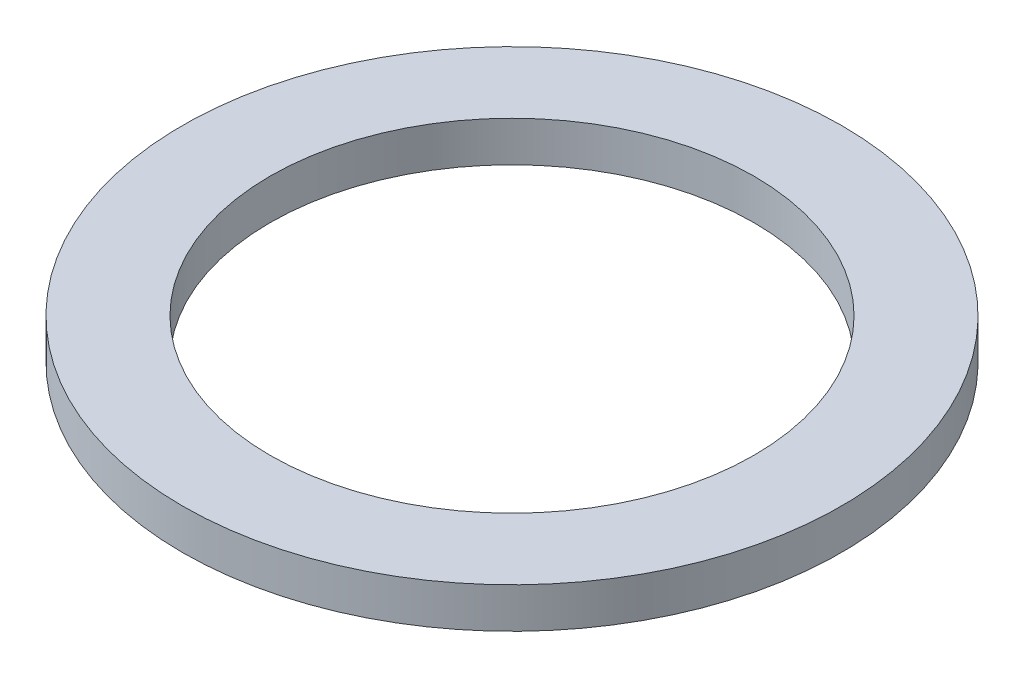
ISO-10303-21;
HEADER;
FILE_DESCRIPTION(('STEP AP214'),'2;1');
FILE_NAME('part.step','',(''),(''),'','','');
FILE_SCHEMA(('AUTOMOTIVE_DESIGN { 1 0 10303 214 1 1 1 1 }'));
ENDSEC;
DATA;
#1=APPLICATION_CONTEXT('core data for automotive mechanical design processes');
#2=APPLICATION_PROTOCOL_DEFINITION('international standard','automotive_design',2000,#1);
#3=PRODUCT_CONTEXT('',#1,'mechanical');
#4=PRODUCT('Part','Part','',(#3));
#5=PRODUCT_RELATED_PRODUCT_CATEGORY('part','',(#4));
#6=PRODUCT_DEFINITION_FORMATION('','',#4);
#7=PRODUCT_DEFINITION_CONTEXT('part definition',#1,'design');
#8=PRODUCT_DEFINITION('design','',#6,#7);
#9=PRODUCT_DEFINITION_SHAPE('','',#8);
#10=(LENGTH_UNIT() NAMED_UNIT(*) SI_UNIT(.MILLI.,.METRE.));
#11=(NAMED_UNIT(*) PLANE_ANGLE_UNIT() SI_UNIT($,.RADIAN.));
#12=(NAMED_UNIT(*) SI_UNIT($,.STERADIAN.) SOLID_ANGLE_UNIT());
#13=UNCERTAINTY_MEASURE_WITH_UNIT(LENGTH_MEASURE(1.E-05),#10,'distance_accuracy_value','');
#14=(GEOMETRIC_REPRESENTATION_CONTEXT(3) GLOBAL_UNCERTAINTY_ASSIGNED_CONTEXT((#13)) GLOBAL_UNIT_ASSIGNED_CONTEXT((#10,
#11,#12)) REPRESENTATION_CONTEXT('',''));
#15=CARTESIAN_POINT('',(0.,0.,0.));
#16=DIRECTION('',(0.,0.,1.));
#17=DIRECTION('',(1.,0.,0.));
#18=AXIS2_PLACEMENT_3D('',#15,#16,#17);
#19=CARTESIAN_POINT('',(0.,0.,0.));
#20=DIRECTION('',(0.,-1.,0.));
#21=DIRECTION('',(0.,0.,-1.));
#22=AXIS2_PLACEMENT_3D('',#19,#20,#21);
#23=CYLINDRICAL_SURFACE('',#22,12.);
#24=CARTESIAN_POINT('',(0.,0.,0.));
#25=DIRECTION('',(0.,-1.,0.));
#26=DIRECTION('',(0.,0.,-1.));
#27=AXIS2_PLACEMENT_3D('',#24,#25,#26);
#28=CIRCLE('',#27,12.);
#29=CARTESIAN_POINT('',(0.,0.,-12.));
#30=VERTEX_POINT('',#29);
#31=EDGE_CURVE('E28',#30,#30,#28,.T.);
#32=ORIENTED_EDGE('',*,*,#31,.T.);
#33=EDGE_LOOP('',(#32));
#34=FACE_BOUND('',#33,.T.);
#35=CARTESIAN_POINT('',(0.,2.,0.));
#36=DIRECTION('',(0.,-1.,0.));
#37=DIRECTION('',(0.,0.,-1.));
#38=AXIS2_PLACEMENT_3D('',#35,#36,#37);
#39=CIRCLE('',#38,12.);
#40=CARTESIAN_POINT('',(0.,2.,-12.));
#41=VERTEX_POINT('',#40);
#42=EDGE_CURVE('E10',#41,#41,#39,.T.);
#43=ORIENTED_EDGE('',*,*,#42,.F.);
#44=EDGE_LOOP('',(#43));
#45=FACE_BOUND('',#44,.T.);
#46=ADVANCED_FACE('F14',(#34,#45),#23,.F.);
#47=CARTESIAN_POINT('',(12.,2.,0.));
#48=DIRECTION('',(0.,1.,0.));
#49=DIRECTION('',(0.,0.,1.));
#50=AXIS2_PLACEMENT_3D('',#47,#48,#49);
#51=PLANE('',#50);
#52=ORIENTED_EDGE('',*,*,#42,.T.);
#53=EDGE_LOOP('',(#52));
#54=FACE_BOUND('',#53,.T.);
#55=CARTESIAN_POINT('',(0.,2.,0.));
#56=DIRECTION('',(0.,-1.,0.));
#57=DIRECTION('',(0.,0.,-1.));
#58=AXIS2_PLACEMENT_3D('',#55,#56,#57);
#59=CIRCLE('',#58,16.35);
#60=CARTESIAN_POINT('',(0.,2.,-16.35));
#61=VERTEX_POINT('',#60);
#62=EDGE_CURVE('E20',#61,#61,#59,.T.);
#63=ORIENTED_EDGE('',*,*,#62,.F.);
#64=EDGE_LOOP('',(#63));
#65=FACE_BOUND('',#64,.T.);
#66=ADVANCED_FACE('F46',(#54,#65),#51,.T.);
#67=CARTESIAN_POINT('',(0.,0.,0.));
#68=DIRECTION('',(0.,-1.,0.));
#69=DIRECTION('',(0.,0.,-1.));
#70=AXIS2_PLACEMENT_3D('',#67,#68,#69);
#71=CYLINDRICAL_SURFACE('',#70,16.35);
#72=ORIENTED_EDGE('',*,*,#62,.T.);
#73=EDGE_LOOP('',(#72));
#74=FACE_BOUND('',#73,.T.);
#75=CARTESIAN_POINT('',(0.,0.,0.));
#76=DIRECTION('',(0.,-1.,0.));
#77=DIRECTION('',(0.,0.,-1.));
#78=AXIS2_PLACEMENT_3D('',#75,#76,#77);
#79=CIRCLE('',#78,16.35);
#80=CARTESIAN_POINT('',(0.,0.,-16.35));
#81=VERTEX_POINT('',#80);
#82=EDGE_CURVE('E24',#81,#81,#79,.T.);
#83=ORIENTED_EDGE('',*,*,#82,.F.);
#84=EDGE_LOOP('',(#83));
#85=FACE_BOUND('',#84,.T.);
#86=ADVANCED_FACE('F38',(#74,#85),#71,.T.);
#87=CARTESIAN_POINT('',(12.,0.,0.));
#88=DIRECTION('',(0.,-1.,0.));
#89=DIRECTION('',(0.,0.,-1.));
#90=AXIS2_PLACEMENT_3D('',#87,#88,#89);
#91=PLANE('',#90);
#92=ORIENTED_EDGE('',*,*,#82,.T.);
#93=EDGE_LOOP('',(#92));
#94=FACE_BOUND('',#93,.T.);
#95=ORIENTED_EDGE('',*,*,#31,.F.);
#96=EDGE_LOOP('',(#95));
#97=FACE_BOUND('',#96,.T.);
#98=ADVANCED_FACE('F36',(#94,#97),#91,.T.);
#99=CLOSED_SHELL('',(#46,#66,#86,#98));
#100=MANIFOLD_SOLID_BREP('B1',#99);
#101=ADVANCED_BREP_SHAPE_REPRESENTATION('',(#18,#100),#14);
#102=SHAPE_DEFINITION_REPRESENTATION(#9,#101);
ENDSEC;
END-ISO-10303-21;
